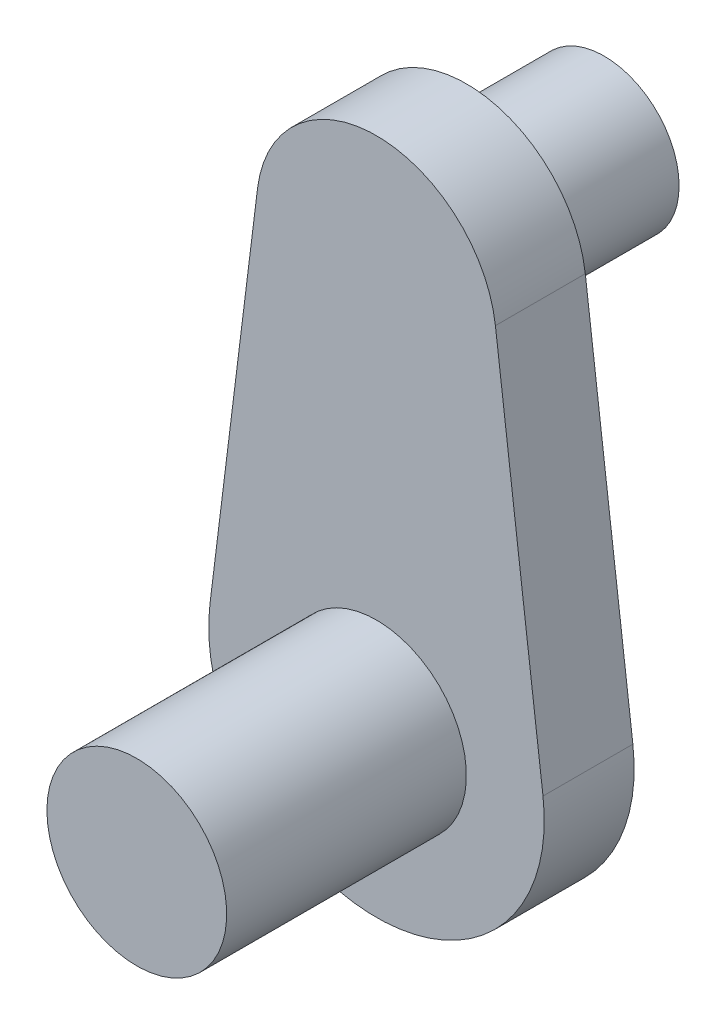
ISO-10303-21;
HEADER;
FILE_DESCRIPTION(('STEP AP214'),'2;1');
FILE_NAME('part.step','',(''),(''),'','','');
FILE_SCHEMA(('AUTOMOTIVE_DESIGN { 1 0 10303 214 1 1 1 1 }'));
ENDSEC;
DATA;
#1=APPLICATION_CONTEXT('core data for automotive mechanical design processes');
#2=APPLICATION_PROTOCOL_DEFINITION('international standard','automotive_design',2000,#1);
#3=PRODUCT_CONTEXT('',#1,'mechanical');
#4=PRODUCT('Part','Part','',(#3));
#5=PRODUCT_RELATED_PRODUCT_CATEGORY('part','',(#4));
#6=PRODUCT_DEFINITION_FORMATION('','',#4);
#7=PRODUCT_DEFINITION_CONTEXT('part definition',#1,'design');
#8=PRODUCT_DEFINITION('design','',#6,#7);
#9=PRODUCT_DEFINITION_SHAPE('','',#8);
#10=(LENGTH_UNIT() NAMED_UNIT(*) SI_UNIT(.MILLI.,.METRE.));
#11=(NAMED_UNIT(*) PLANE_ANGLE_UNIT() SI_UNIT($,.RADIAN.));
#12=(NAMED_UNIT(*) SI_UNIT($,.STERADIAN.) SOLID_ANGLE_UNIT());
#13=UNCERTAINTY_MEASURE_WITH_UNIT(LENGTH_MEASURE(1.E-05),#10,'distance_accuracy_value','');
#14=(GEOMETRIC_REPRESENTATION_CONTEXT(3) GLOBAL_UNCERTAINTY_ASSIGNED_CONTEXT((#13)) GLOBAL_UNIT_ASSIGNED_CONTEXT((#10,
#11,#12)) REPRESENTATION_CONTEXT('',''));
#15=CARTESIAN_POINT('',(0.,0.,0.));
#16=DIRECTION('',(0.,0.,1.));
#17=DIRECTION('',(1.,0.,0.));
#18=AXIS2_PLACEMENT_3D('',#15,#16,#17);
#19=CARTESIAN_POINT('',(0.,65.,15.));
#20=DIRECTION('',(0.,0.,-1.));
#21=DIRECTION('',(-1.,0.,0.));
#22=AXIS2_PLACEMENT_3D('',#19,#20,#21);
#23=CYLINDRICAL_SURFACE('',#22,20.);
#24=CARTESIAN_POINT('',(0.,65.,0.));
#25=DIRECTION('',(0.,0.,1.));
#26=DIRECTION('',(1.,0.,0.));
#27=AXIS2_PLACEMENT_3D('',#24,#25,#26);
#28=CIRCLE('',#27,20.);
#29=CARTESIAN_POINT('',(19.8479426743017,67.4615384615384,0.));
#30=VERTEX_POINT('',#29);
#31=CARTESIAN_POINT('',(-19.8479426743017,67.4615384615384,0.));
#32=VERTEX_POINT('',#31);
#33=EDGE_CURVE('E111',#30,#32,#28,.T.);
#34=ORIENTED_EDGE('',*,*,#33,.T.);
#35=DIRECTION('',(0.,0.,-1.));
#36=VECTOR('',#35,1.);
#37=CARTESIAN_POINT('',(-19.8479426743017,67.4615384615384,15.));
#38=LINE('',#37,#36);
#39=CARTESIAN_POINT('',(-19.8479426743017,67.4615384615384,15.));
#40=VERTEX_POINT('',#39);
#41=EDGE_CURVE('E11',#40,#32,#38,.T.);
#42=ORIENTED_EDGE('',*,*,#41,.F.);
#43=CARTESIAN_POINT('',(0.,65.,15.));
#44=DIRECTION('',(0.,0.,1.));
#45=DIRECTION('',(1.,0.,0.));
#46=AXIS2_PLACEMENT_3D('',#43,#44,#45);
#47=CIRCLE('',#46,20.);
#48=CARTESIAN_POINT('',(19.8479426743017,67.4615384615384,15.));
#49=VERTEX_POINT('',#48);
#50=EDGE_CURVE('E93',#49,#40,#47,.T.);
#51=ORIENTED_EDGE('',*,*,#50,.F.);
#52=DIRECTION('',(0.,0.,-1.));
#53=VECTOR('',#52,1.);
#54=CARTESIAN_POINT('',(19.8479426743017,67.4615384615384,15.));
#55=LINE('',#54,#53);
#56=EDGE_CURVE('E107',#49,#30,#55,.T.);
#57=ORIENTED_EDGE('',*,*,#56,.T.);
#58=EDGE_LOOP('',(#34,#42,#51,#57));
#59=FACE_BOUND('',#58,.T.);
#60=ADVANCED_FACE('F40',(#59),#23,.T.);
#61=CARTESIAN_POINT('',(-19.8479426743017,67.4615384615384,15.));
#62=DIRECTION('',(0.992397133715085,-0.123076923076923,0.));
#63=DIRECTION('',(0.123076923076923,0.992397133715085,0.));
#64=AXIS2_PLACEMENT_3D('',#61,#62,#63);
#65=PLANE('',#64);
#66=DIRECTION('',(-0.123076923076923,-0.992397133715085,0.));
#67=VECTOR('',#66,1.);
#68=CARTESIAN_POINT('',(-19.8479426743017,67.4615384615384,0.));
#69=LINE('',#68,#67);
#70=CARTESIAN_POINT('',(-27.7871197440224,3.44615384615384,0.));
#71=VERTEX_POINT('',#70);
#72=EDGE_CURVE('E98',#32,#71,#69,.T.);
#73=ORIENTED_EDGE('',*,*,#72,.T.);
#74=DIRECTION('',(0.,0.,-1.));
#75=VECTOR('',#74,1.);
#76=CARTESIAN_POINT('',(-27.7871197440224,3.44615384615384,15.));
#77=LINE('',#76,#75);
#78=CARTESIAN_POINT('',(-27.7871197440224,3.44615384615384,15.));
#79=VERTEX_POINT('',#78);
#80=EDGE_CURVE('E50',#79,#71,#77,.T.);
#81=ORIENTED_EDGE('',*,*,#80,.F.);
#82=DIRECTION('',(-0.123076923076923,-0.992397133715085,0.));
#83=VECTOR('',#82,1.);
#84=CARTESIAN_POINT('',(-19.8479426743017,67.4615384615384,15.));
#85=LINE('',#84,#83);
#86=EDGE_CURVE('E88',#40,#79,#85,.T.);
#87=ORIENTED_EDGE('',*,*,#86,.F.);
#88=ORIENTED_EDGE('',*,*,#41,.T.);
#89=EDGE_LOOP('',(#73,#81,#87,#88));
#90=FACE_BOUND('',#89,.T.);
#91=ADVANCED_FACE('F97',(#90),#65,.F.);
#92=CARTESIAN_POINT('',(0.,0.,15.));
#93=DIRECTION('',(0.,0.,-1.));
#94=DIRECTION('',(-1.,0.,0.));
#95=AXIS2_PLACEMENT_3D('',#92,#93,#94);
#96=CYLINDRICAL_SURFACE('',#95,28.);
#97=CARTESIAN_POINT('',(0.,0.,0.));
#98=DIRECTION('',(0.,0.,1.));
#99=DIRECTION('',(1.,0.,0.));
#100=AXIS2_PLACEMENT_3D('',#97,#98,#99);
#101=CIRCLE('',#100,28.);
#102=CARTESIAN_POINT('',(27.7871197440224,3.44615384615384,0.));
#103=VERTEX_POINT('',#102);
#104=EDGE_CURVE('E75',#71,#103,#101,.T.);
#105=ORIENTED_EDGE('',*,*,#104,.T.);
#106=DIRECTION('',(0.,0.,-1.));
#107=VECTOR('',#106,1.);
#108=CARTESIAN_POINT('',(27.7871197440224,3.44615384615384,15.));
#109=LINE('',#108,#107);
#110=CARTESIAN_POINT('',(27.7871197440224,3.44615384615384,15.));
#111=VERTEX_POINT('',#110);
#112=EDGE_CURVE('E100',#111,#103,#109,.T.);
#113=ORIENTED_EDGE('',*,*,#112,.F.);
#114=CARTESIAN_POINT('',(0.,0.,15.));
#115=DIRECTION('',(0.,0.,1.));
#116=DIRECTION('',(1.,0.,0.));
#117=AXIS2_PLACEMENT_3D('',#114,#115,#116);
#118=CIRCLE('',#117,28.);
#119=EDGE_CURVE('E91',#79,#111,#118,.T.);
#120=ORIENTED_EDGE('',*,*,#119,.F.);
#121=ORIENTED_EDGE('',*,*,#80,.T.);
#122=EDGE_LOOP('',(#105,#113,#120,#121));
#123=FACE_BOUND('',#122,.T.);
#124=ADVANCED_FACE('F102',(#123),#96,.T.);
#125=CARTESIAN_POINT('',(19.8479426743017,67.4615384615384,15.));
#126=DIRECTION('',(-0.992397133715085,-0.123076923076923,0.));
#127=DIRECTION('',(0.123076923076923,-0.992397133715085,0.));
#128=AXIS2_PLACEMENT_3D('',#125,#126,#127);
#129=PLANE('',#128);
#130=DIRECTION('',(-0.123076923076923,0.992397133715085,0.));
#131=VECTOR('',#130,1.);
#132=CARTESIAN_POINT('',(19.8479426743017,67.4615384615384,0.));
#133=LINE('',#132,#131);
#134=EDGE_CURVE('E81',#103,#30,#133,.T.);
#135=ORIENTED_EDGE('',*,*,#134,.T.);
#136=ORIENTED_EDGE('',*,*,#56,.F.);
#137=DIRECTION('',(-0.123076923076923,0.992397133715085,0.));
#138=VECTOR('',#137,1.);
#139=CARTESIAN_POINT('',(19.8479426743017,67.4615384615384,15.));
#140=LINE('',#139,#138);
#141=EDGE_CURVE('E58',#111,#49,#140,.T.);
#142=ORIENTED_EDGE('',*,*,#141,.F.);
#143=ORIENTED_EDGE('',*,*,#112,.T.);
#144=EDGE_LOOP('',(#135,#136,#142,#143));
#145=FACE_BOUND('',#144,.T.);
#146=ADVANCED_FACE('F127',(#145),#129,.F.);
#147=CARTESIAN_POINT('',(0.,65.,15.));
#148=DIRECTION('',(0.,0.,1.));
#149=DIRECTION('',(1.,0.,0.));
#150=AXIS2_PLACEMENT_3D('',#147,#148,#149);
#151=PLANE('',#150);
#152=CARTESIAN_POINT('',(0.,0.,15.));
#153=DIRECTION('',(0.,0.,1.));
#154=DIRECTION('',(1.,0.,0.));
#155=AXIS2_PLACEMENT_3D('',#152,#153,#154);
#156=CIRCLE('',#155,15.);
#157=CARTESIAN_POINT('',(-15.,0.,15.));
#158=VERTEX_POINT('',#157);
#159=EDGE_CURVE('E135',#158,#158,#156,.T.);
#160=ORIENTED_EDGE('',*,*,#159,.F.);
#161=EDGE_LOOP('',(#160));
#162=FACE_BOUND('',#161,.T.);
#163=ORIENTED_EDGE('',*,*,#50,.T.);
#164=ORIENTED_EDGE('',*,*,#86,.T.);
#165=ORIENTED_EDGE('',*,*,#119,.T.);
#166=ORIENTED_EDGE('',*,*,#141,.T.);
#167=EDGE_LOOP('',(#163,#164,#165,#166));
#168=FACE_BOUND('',#167,.T.);
#169=ADVANCED_FACE('F89',(#162,#168),#151,.T.);
#170=CARTESIAN_POINT('',(0.,65.,0.));
#171=DIRECTION('',(0.,0.,1.));
#172=DIRECTION('',(1.,0.,0.));
#173=AXIS2_PLACEMENT_3D('',#170,#171,#172);
#174=PLANE('',#173);
#175=CARTESIAN_POINT('',(0.,65.,0.));
#176=DIRECTION('',(0.,0.,1.));
#177=DIRECTION('',(1.,0.,0.));
#178=AXIS2_PLACEMENT_3D('',#175,#176,#177);
#179=CIRCLE('',#178,12.5);
#180=CARTESIAN_POINT('',(12.5,65.,0.));
#181=VERTEX_POINT('',#180);
#182=EDGE_CURVE('E43',#181,#181,#179,.T.);
#183=ORIENTED_EDGE('',*,*,#182,.T.);
#184=EDGE_LOOP('',(#183));
#185=FACE_BOUND('',#184,.T.);
#186=ORIENTED_EDGE('',*,*,#33,.F.);
#187=ORIENTED_EDGE('',*,*,#134,.F.);
#188=ORIENTED_EDGE('',*,*,#104,.F.);
#189=ORIENTED_EDGE('',*,*,#72,.F.);
#190=EDGE_LOOP('',(#186,#187,#188,#189));
#191=FACE_BOUND('',#190,.T.);
#192=ADVANCED_FACE('F130',(#185,#191),#174,.F.);
#193=CARTESIAN_POINT('',(0.,0.,55.));
#194=DIRECTION('',(0.,0.,-1.));
#195=DIRECTION('',(-1.,0.,0.));
#196=AXIS2_PLACEMENT_3D('',#193,#194,#195);
#197=CYLINDRICAL_SURFACE('',#196,15.);
#198=CARTESIAN_POINT('',(0.,0.,55.));
#199=DIRECTION('',(0.,0.,1.));
#200=DIRECTION('',(1.,0.,0.));
#201=AXIS2_PLACEMENT_3D('',#198,#199,#200);
#202=CIRCLE('',#201,15.);
#203=CARTESIAN_POINT('',(-15.,0.,54.9999999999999));
#204=VERTEX_POINT('',#203);
#205=EDGE_CURVE('E115',#204,#204,#202,.T.);
#206=CARTESIAN_POINT('',(-15.,0.,54.9999999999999));
#207=CARTESIAN_POINT('',(-15.,0.,54.5833333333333));
#208=CARTESIAN_POINT('',(-15.,0.,54.1666666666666));
#209=CARTESIAN_POINT('',(-15.,0.,53.3333333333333));
#210=CARTESIAN_POINT('',(-15.,0.,52.9166666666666));
#211=CARTESIAN_POINT('',(-15.,0.,52.0833333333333));
#212=CARTESIAN_POINT('',(-15.,0.,51.6666666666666));
#213=CARTESIAN_POINT('',(-15.,0.,50.8333333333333));
#214=CARTESIAN_POINT('',(-15.,0.,50.4166666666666));
#215=CARTESIAN_POINT('',(-15.,0.,49.5833333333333));
#216=CARTESIAN_POINT('',(-15.,0.,49.1666666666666));
#217=CARTESIAN_POINT('',(-15.,0.,48.3333333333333));
#218=CARTESIAN_POINT('',(-15.,0.,47.9166666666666));
#219=CARTESIAN_POINT('',(-15.,0.,47.0833333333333));
#220=CARTESIAN_POINT('',(-15.,0.,46.6666666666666));
#221=CARTESIAN_POINT('',(-15.,0.,45.8333333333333));
#222=CARTESIAN_POINT('',(-15.,0.,45.4166666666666));
#223=CARTESIAN_POINT('',(-15.,0.,44.5833333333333));
#224=CARTESIAN_POINT('',(-15.,0.,44.1666666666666));
#225=CARTESIAN_POINT('',(-15.,0.,43.3333333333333));
#226=CARTESIAN_POINT('',(-15.,0.,42.9166666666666));
#227=CARTESIAN_POINT('',(-15.,0.,42.0833333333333));
#228=CARTESIAN_POINT('',(-15.,0.,41.6666666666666));
#229=CARTESIAN_POINT('',(-15.,0.,40.8333333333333));
#230=CARTESIAN_POINT('',(-15.,0.,40.4166666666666));
#231=CARTESIAN_POINT('',(-15.,0.,39.5833333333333));
#232=CARTESIAN_POINT('',(-15.,0.,39.1666666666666));
#233=CARTESIAN_POINT('',(-15.,0.,38.3333333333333));
#234=CARTESIAN_POINT('',(-15.,0.,37.9166666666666));
#235=CARTESIAN_POINT('',(-15.,0.,37.0833333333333));
#236=CARTESIAN_POINT('',(-15.,0.,36.6666666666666));
#237=CARTESIAN_POINT('',(-15.,0.,35.8333333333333));
#238=CARTESIAN_POINT('',(-15.,0.,35.4166666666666));
#239=CARTESIAN_POINT('',(-15.,0.,34.5833333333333));
#240=CARTESIAN_POINT('',(-15.,0.,34.1666666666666));
#241=CARTESIAN_POINT('',(-15.,0.,33.3333333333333));
#242=CARTESIAN_POINT('',(-15.,0.,32.9166666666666));
#243=CARTESIAN_POINT('',(-15.,0.,32.0833333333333));
#244=CARTESIAN_POINT('',(-15.,0.,31.6666666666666));
#245=CARTESIAN_POINT('',(-15.,0.,30.8333333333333));
#246=CARTESIAN_POINT('',(-15.,0.,30.4166666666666));
#247=CARTESIAN_POINT('',(-15.,0.,29.5833333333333));
#248=CARTESIAN_POINT('',(-15.,0.,29.1666666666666));
#249=CARTESIAN_POINT('',(-15.,0.,28.3333333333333));
#250=CARTESIAN_POINT('',(-15.,0.,27.9166666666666));
#251=CARTESIAN_POINT('',(-15.,0.,27.0833333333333));
#252=CARTESIAN_POINT('',(-15.,0.,26.6666666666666));
#253=CARTESIAN_POINT('',(-15.,0.,25.8333333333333));
#254=CARTESIAN_POINT('',(-15.,0.,25.4166666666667));
#255=CARTESIAN_POINT('',(-15.,0.,24.5833333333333));
#256=CARTESIAN_POINT('',(-15.,0.,24.1666666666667));
#257=CARTESIAN_POINT('',(-15.,0.,23.3333333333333));
#258=CARTESIAN_POINT('',(-15.,0.,22.9166666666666));
#259=CARTESIAN_POINT('',(-15.,0.,22.0833333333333));
#260=CARTESIAN_POINT('',(-15.,0.,21.6666666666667));
#261=CARTESIAN_POINT('',(-15.,0.,20.8333333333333));
#262=CARTESIAN_POINT('',(-15.,0.,20.4166666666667));
#263=CARTESIAN_POINT('',(-15.,0.,19.5833333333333));
#264=CARTESIAN_POINT('',(-15.,0.,19.1666666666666));
#265=CARTESIAN_POINT('',(-15.,0.,18.3333333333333));
#266=CARTESIAN_POINT('',(-15.,0.,17.9166666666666));
#267=CARTESIAN_POINT('',(-15.,0.,17.0833333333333));
#268=CARTESIAN_POINT('',(-15.,0.,16.6666666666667));
#269=CARTESIAN_POINT('',(-15.,0.,15.8333333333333));
#270=CARTESIAN_POINT('',(-15.,0.,15.4166666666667));
#271=CARTESIAN_POINT('',(-15.,0.,15.));
#272=B_SPLINE_CURVE_WITH_KNOTS('',3,(#206,#207,#208,#209,#210,#211,#212,#213,#214,#215,#216,
#217,#218,#219,#220,#221,#222,#223,#224,#225,#226,#227,#228,#229,#230,#231,#232,#233,#234,#235,
#236,#237,#238,#239,#240,#241,#242,#243,#244,#245,#246,#247,#248,#249,#250,#251,#252,#253,#254,
#255,#256,#257,#258,#259,#260,#261,#262,#263,#264,#265,#266,#267,#268,#269,#270,#271),
.UNSPECIFIED.,.F.,.F.,(4,2,2,2,2,2,2,2,2,2,2,2,2,2,2,2,2,2,2,2,2,2,2,2,2,2,2,2,2,2,2,2,4),(0.,
1.24999999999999,2.5,3.74999999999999,4.99999999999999,6.24999999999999,7.49999999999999,
8.74999999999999,9.99999999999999,11.25,12.5,13.75,15.,16.25,17.5,18.75,20.,21.25,22.5,23.75,
25.,26.25,27.5,28.75,30.,31.25,32.5,33.75,35.,36.25,37.5,38.75,40.),.UNSPECIFIED.);
#273=EDGE_CURVE('BSEAM164',#204,#158,#272,.T.);
#274=ORIENTED_EDGE('',*,*,#205,.F.);
#275=ORIENTED_EDGE('',*,*,#159,.T.);
#276=ORIENTED_EDGE('',*,*,#273,.T.);
#277=ORIENTED_EDGE('',*,*,#273,.F.);
#278=EDGE_LOOP('',(#274,#276,#275,#277));
#279=FACE_BOUND('',#278,.T.);
#280=ADVANCED_FACE('F164',(#279),#197,.T.);
#281=CARTESIAN_POINT('',(0.,0.,55.));
#282=DIRECTION('',(0.,0.,1.));
#283=DIRECTION('',(1.,0.,0.));
#284=AXIS2_PLACEMENT_3D('',#281,#282,#283);
#285=PLANE('',#284);
#286=ORIENTED_EDGE('',*,*,#205,.T.);
#287=EDGE_LOOP('',(#286));
#288=FACE_BOUND('',#287,.T.);
#289=ADVANCED_FACE('F156',(#288),#285,.T.);
#290=CARTESIAN_POINT('',(0.,65.,-23.));
#291=DIRECTION('',(0.,0.,1.));
#292=DIRECTION('',(1.,0.,0.));
#293=AXIS2_PLACEMENT_3D('',#290,#291,#292);
#294=CYLINDRICAL_SURFACE('',#293,12.5);
#295=CARTESIAN_POINT('',(0.,65.,-23.));
#296=DIRECTION('',(0.,0.,1.));
#297=DIRECTION('',(1.,0.,0.));
#298=AXIS2_PLACEMENT_3D('',#295,#296,#297);
#299=CIRCLE('',#298,12.5);
#300=CARTESIAN_POINT('',(12.5,65.,-23.));
#301=VERTEX_POINT('',#300);
#302=EDGE_CURVE('E141',#301,#301,#299,.T.);
#303=CARTESIAN_POINT('',(12.5,65.,-23.));
#304=CARTESIAN_POINT('',(12.5,65.,-22.7604166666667));
#305=CARTESIAN_POINT('',(12.5,65.,-22.5208333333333));
#306=CARTESIAN_POINT('',(12.5,65.,-22.0416666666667));
#307=CARTESIAN_POINT('',(12.5,65.,-21.8020833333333));
#308=CARTESIAN_POINT('',(12.5,65.,-21.3229166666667));
#309=CARTESIAN_POINT('',(12.5,65.,-21.0833333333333));
#310=CARTESIAN_POINT('',(12.5,65.,-20.6041666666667));
#311=CARTESIAN_POINT('',(12.5,65.,-20.3645833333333));
#312=CARTESIAN_POINT('',(12.5,65.,-19.8854166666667));
#313=CARTESIAN_POINT('',(12.5,65.,-19.6458333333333));
#314=CARTESIAN_POINT('',(12.5,65.,-19.1666666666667));
#315=CARTESIAN_POINT('',(12.5,65.,-18.9270833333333));
#316=CARTESIAN_POINT('',(12.5,65.,-18.4479166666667));
#317=CARTESIAN_POINT('',(12.5,65.,-18.2083333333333));
#318=CARTESIAN_POINT('',(12.5,65.,-17.7291666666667));
#319=CARTESIAN_POINT('',(12.5,65.,-17.4895833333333));
#320=CARTESIAN_POINT('',(12.5,65.,-17.0104166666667));
#321=CARTESIAN_POINT('',(12.5,65.,-16.7708333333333));
#322=CARTESIAN_POINT('',(12.5,65.,-16.2916666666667));
#323=CARTESIAN_POINT('',(12.5,65.,-16.0520833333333));
#324=CARTESIAN_POINT('',(12.5,65.,-15.5729166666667));
#325=CARTESIAN_POINT('',(12.5,65.,-15.3333333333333));
#326=CARTESIAN_POINT('',(12.5,65.,-14.8541666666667));
#327=CARTESIAN_POINT('',(12.5,65.,-14.6145833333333));
#328=CARTESIAN_POINT('',(12.5,65.,-14.1354166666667));
#329=CARTESIAN_POINT('',(12.5,65.,-13.8958333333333));
#330=CARTESIAN_POINT('',(12.5,65.,-13.4166666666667));
#331=CARTESIAN_POINT('',(12.5,65.,-13.1770833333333));
#332=CARTESIAN_POINT('',(12.5,65.,-12.6979166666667));
#333=CARTESIAN_POINT('',(12.5,65.,-12.4583333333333));
#334=CARTESIAN_POINT('',(12.5,65.,-11.9791666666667));
#335=CARTESIAN_POINT('',(12.5,65.,-11.7395833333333));
#336=CARTESIAN_POINT('',(12.5,65.,-11.2604166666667));
#337=CARTESIAN_POINT('',(12.5,65.,-11.0208333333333));
#338=CARTESIAN_POINT('',(12.5,65.,-10.5416666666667));
#339=CARTESIAN_POINT('',(12.5,65.,-10.3020833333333));
#340=CARTESIAN_POINT('',(12.5,65.,-9.82291666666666));
#341=CARTESIAN_POINT('',(12.5,65.,-9.58333333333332));
#342=CARTESIAN_POINT('',(12.5,65.,-9.10416666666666));
#343=CARTESIAN_POINT('',(12.5,65.,-8.86458333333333));
#344=CARTESIAN_POINT('',(12.5,65.,-8.38541666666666));
#345=CARTESIAN_POINT('',(12.5,65.,-8.14583333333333));
#346=CARTESIAN_POINT('',(12.5,65.,-7.66666666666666));
#347=CARTESIAN_POINT('',(12.5,65.,-7.42708333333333));
#348=CARTESIAN_POINT('',(12.5,65.,-6.94791666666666));
#349=CARTESIAN_POINT('',(12.5,65.,-6.70833333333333));
#350=CARTESIAN_POINT('',(12.5,65.,-6.22916666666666));
#351=CARTESIAN_POINT('',(12.5,65.,-5.98958333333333));
#352=CARTESIAN_POINT('',(12.5,65.,-5.51041666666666));
#353=CARTESIAN_POINT('',(12.5,65.,-5.27083333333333));
#354=CARTESIAN_POINT('',(12.5,65.,-4.79166666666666));
#355=CARTESIAN_POINT('',(12.5,65.,-4.55208333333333));
#356=CARTESIAN_POINT('',(12.5,65.,-4.07291666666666));
#357=CARTESIAN_POINT('',(12.5,65.,-3.83333333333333));
#358=CARTESIAN_POINT('',(12.5,65.,-3.35416666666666));
#359=CARTESIAN_POINT('',(12.5,65.,-3.11458333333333));
#360=CARTESIAN_POINT('',(12.5,65.,-2.63541666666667));
#361=CARTESIAN_POINT('',(12.5,65.,-2.39583333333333));
#362=CARTESIAN_POINT('',(12.5,65.,-1.91666666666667));
#363=CARTESIAN_POINT('',(12.5,65.,-1.67708333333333));
#364=CARTESIAN_POINT('',(12.5,65.,-1.19791666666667));
#365=CARTESIAN_POINT('',(12.5,65.,-0.958333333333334));
#366=CARTESIAN_POINT('',(12.5,65.,-0.479166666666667));
#367=CARTESIAN_POINT('',(12.5,65.,-0.239583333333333));
#368=CARTESIAN_POINT('',(12.5,65.,0.));
#369=B_SPLINE_CURVE_WITH_KNOTS('',3,(#303,#304,#305,#306,#307,#308,#309,#310,#311,#312,#313,
#314,#315,#316,#317,#318,#319,#320,#321,#322,#323,#324,#325,#326,#327,#328,#329,#330,#331,#332,
#333,#334,#335,#336,#337,#338,#339,#340,#341,#342,#343,#344,#345,#346,#347,#348,#349,#350,#351,
#352,#353,#354,#355,#356,#357,#358,#359,#360,#361,#362,#363,#364,#365,#366,#367,#368),
.UNSPECIFIED.,.F.,.F.,(4,2,2,2,2,2,2,2,2,2,2,2,2,2,2,2,2,2,2,2,2,2,2,2,2,2,2,2,2,2,2,2,4),(0.,
0.718750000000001,1.4375,2.15625,2.875,3.59375,4.3125,5.03125,5.75,6.46875,7.1875,7.90625,8.625,
9.34375,10.0625,10.78125,11.5,12.21875,12.9375,13.65625,14.375,15.09375,15.8125,16.53125,17.25,
17.96875,18.6875,19.40625,20.125,20.84375,21.5625,22.28125,23.),.UNSPECIFIED.);
#370=EDGE_CURVE('BSEAM153',#301,#181,#369,.T.);
#371=ORIENTED_EDGE('',*,*,#302,.T.);
#372=ORIENTED_EDGE('',*,*,#182,.F.);
#373=ORIENTED_EDGE('',*,*,#370,.T.);
#374=ORIENTED_EDGE('',*,*,#370,.F.);
#375=EDGE_LOOP('',(#371,#373,#372,#374));
#376=FACE_BOUND('',#375,.T.);
#377=ADVANCED_FACE('F153',(#376),#294,.T.);
#378=CARTESIAN_POINT('',(0.,65.,-23.));
#379=DIRECTION('',(0.,0.,1.));
#380=DIRECTION('',(1.,0.,0.));
#381=AXIS2_PLACEMENT_3D('',#378,#379,#380);
#382=PLANE('',#381);
#383=ORIENTED_EDGE('',*,*,#302,.F.);
#384=EDGE_LOOP('',(#383));
#385=FACE_BOUND('',#384,.T.);
#386=ADVANCED_FACE('F155',(#385),#382,.F.);
#387=CLOSED_SHELL('',(#60,#91,#124,#146,#169,#192,#280,#289,#377,#386));
#388=MANIFOLD_SOLID_BREP('B2',#387);
#389=ADVANCED_BREP_SHAPE_REPRESENTATION('',(#18,#388),#14);
#390=SHAPE_DEFINITION_REPRESENTATION(#9,#389);
ENDSEC;
END-ISO-10303-21;
